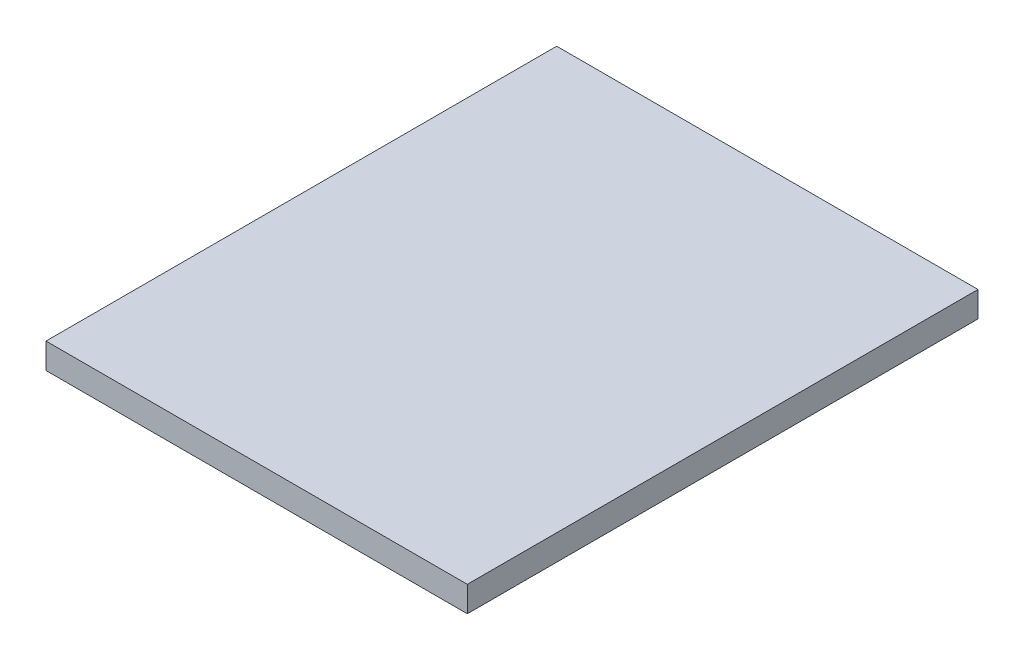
from build123d import *

# Parameters (mm, degrees)
SKETCH1_W      = 33
SKETCH1_H      = 40
EXTRUDE1_DEPTH = 2


with BuildPart() as part:
    # Sketch1 → Extrude1 (new body)
    with BuildSketch(Plane(origin=(0, 0, 0), x_dir=(1, 0, 0), z_dir=(0, 1, 0))):
        with Locations((16.5, 0)):
            Rectangle(SKETCH1_W, SKETCH1_H)
    extrude(amount=EXTRUDE1_DEPTH)


solid = part.part
